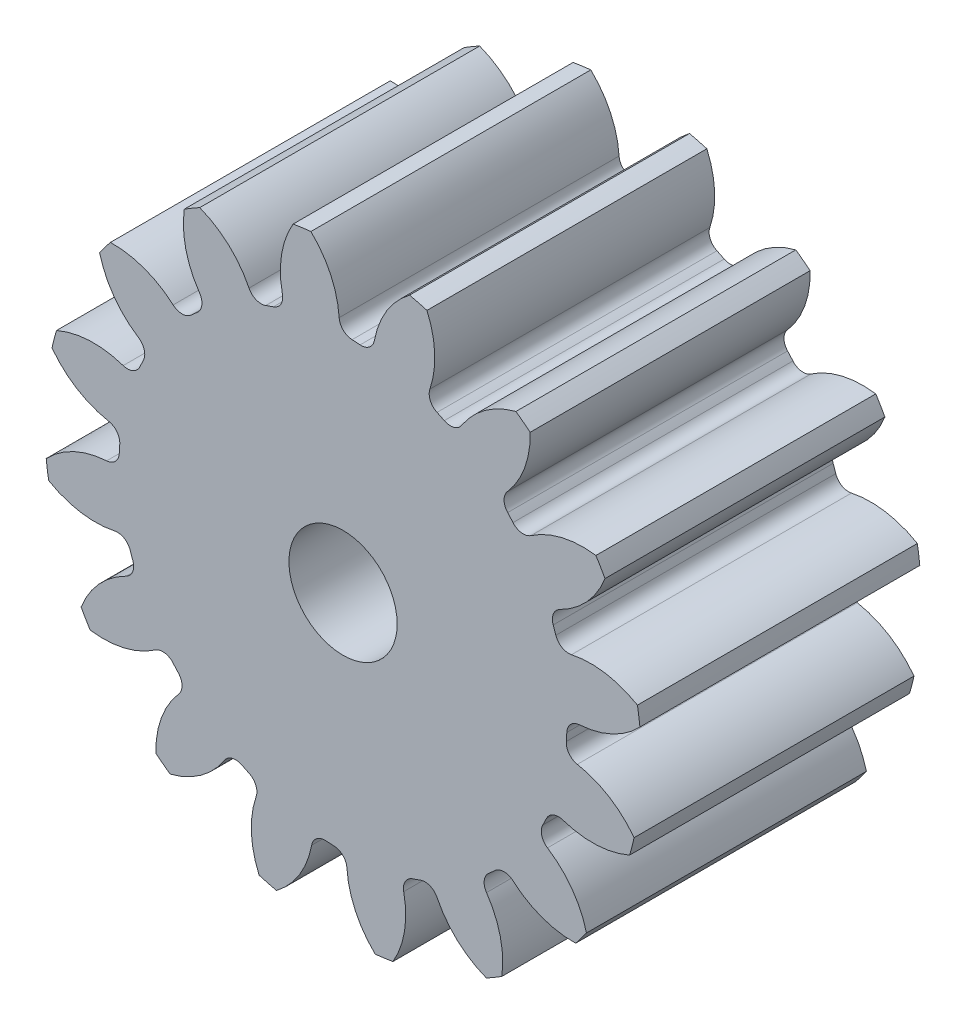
from build123d import *

# Parameters (mm, degrees)
SKETCH3_R         = 101.6
GEARBODY_DEPTH    = 95.25
TOOTHCUT_DEPTH    = 173.388173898
CIRPATTERN1_COUNT = 16
BOREDIA_R         = 18.415
BORE_DEPTH        = 12700


with BuildPart() as part:
    # Sketch3 → gearBody (new body)
    with BuildSketch(Plane.XY):
        Circle(SKETCH3_R)
    extrude(amount=GEARBODY_DEPTH)

    # Sketch2 → toothCut (cut, through all)
    with BuildSketch(Plane.XY):
        with BuildLine():
            ThreePointArc((75.97777844, -5.815254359), (76.070027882, -4.44869172), (76.137699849, -3.080691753))
            ThreePointArc((76.137699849, -3.080691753), (77.440138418, -0.057601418), (80.430439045, 1.318452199))
            ThreePointArc((80.430439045, 1.318452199), (92.017954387, 4.376557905), (101.6, 11.574260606))
            ThreePointArc((101.6, 11.574260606), (102.082727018, -5.9699542), (99.558259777, -23.338303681))
            ThreePointArc((99.558259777, -23.338303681), (90.880529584, -15.072741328), (79.72847103, -10.684790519))
            ThreePointArc((79.72847103, -10.684790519), (76.918953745, -8.969554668), (75.97777844, -5.815254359))
        make_face()
    toothcut = extrude(amount=TOOTHCUT_DEPTH, mode=Mode.SUBTRACT)

    # CirPattern1: toothCut ×16 about axis
    cirpattern1_axis = Axis((0, 0, 0), (0, 0, 1))
    for i in range(1, CIRPATTERN1_COUNT):
        add(toothcut.rotate(cirpattern1_axis, i * 360 / CIRPATTERN1_COUNT), mode=Mode.SUBTRACT)

    # boreDia → bore (cut, symmetric)
    with BuildSketch(Plane.XY):
        Circle(BOREDIA_R)
    extrude(amount=BORE_DEPTH, both=True, mode=Mode.SUBTRACT)


solid = part.part
